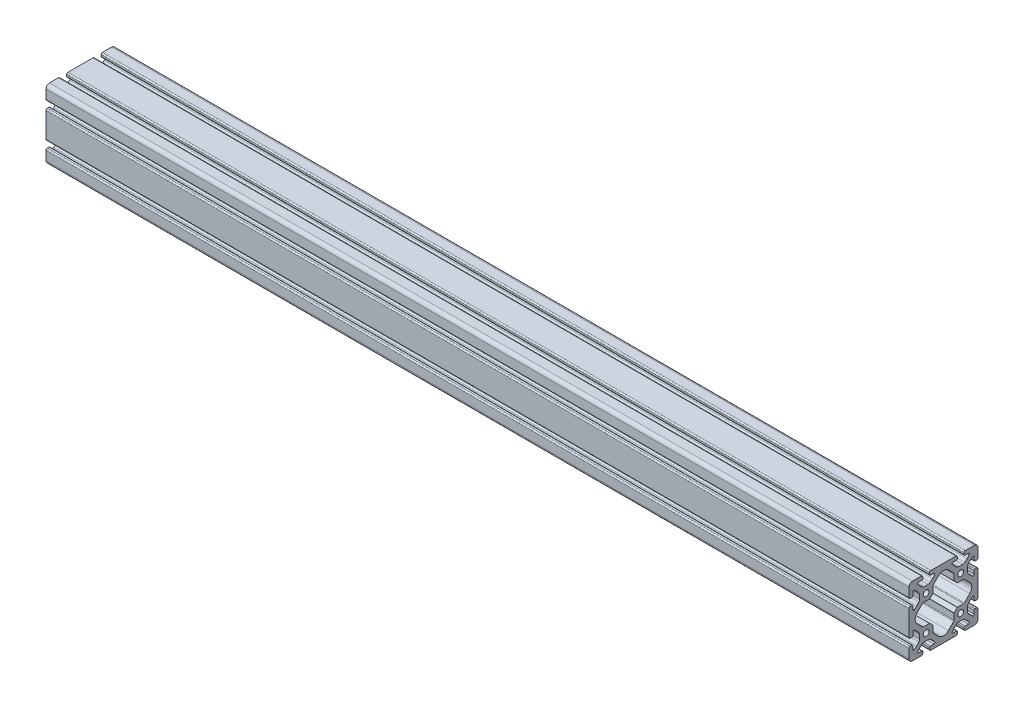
from build123d import *

# Parameters (mm, degrees)
MODEL_R                = 3.4
STRUKTURBAUTEIL1_DEPTH = 1000


with BuildPart() as part:
    # Model → Strukturbauteil1 (new body)
    with BuildSketch(Plane(origin=(0, 0, 0), x_dir=(0, 0, -1), z_dir=(1, 0, 0))):
        with BuildLine():
            Line((-40, -25.5), (-40, -36))
            ThreePointArc((-40, -36), (-38.828427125, -38.828427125), (-36, -40))
            Line((-36, -40), (-25.5, -40))
            ThreePointArc((-25.5, -40), (-24.439339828, -39.560660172), (-24, -38.5))
            Line((-24, -38.5), (-24, -36.5))
            ThreePointArc((-24, -36.5), (-24.292893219, -35.792893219), (-25, -35.5))
            Line((-25, -35.5), (-28.91611505, -35.5))
            ThreePointArc((-28.91611505, -35.5), (-29.883468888, -34.905025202), (-29.788807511, -33.773297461))
            Line((-29.788807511, -33.773297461), (-27.378794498, -30.963551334))
            Line((-27.378794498, -30.963551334), (-24.580305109, -28.54047619))
            ThreePointArc((-24.580305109, -28.54047619), (-23.45041558, -27.952757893), (-22.193056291, -27.75))
            Line((-22.193056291, -27.75), (-17.806943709, -27.75))
            ThreePointArc((-17.806943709, -27.75), (-16.54958442, -27.952757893), (-15.419694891, -28.54047619))
            Line((-15.419694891, -28.54047619), (-12.621205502, -30.963551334))
            Line((-12.621205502, -30.963551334), (-10.211192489, -33.773297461))
            ThreePointArc((-10.211192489, -33.773297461), (-10.116531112, -34.905025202), (-11.08388495, -35.5))
            Line((-11.08388495, -35.5), (-15, -35.5))
            ThreePointArc((-15, -35.5), (-15.707106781, -35.792893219), (-16, -36.5))
            Line((-16, -36.5), (-16, -38.5))
            ThreePointArc((-16, -38.5), (-15.560660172, -39.560660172), (-14.5, -40))
            Line((-14.5, -40), (14.5, -40))
            ThreePointArc((14.5, -40), (15.560660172, -39.560660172), (16, -38.5))
            Line((16, -38.5), (16, -36.5))
            ThreePointArc((16, -36.5), (15.707106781, -35.792893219), (15, -35.5))
            Line((15, -35.5), (11.08388495, -35.5))
            ThreePointArc((11.08388495, -35.5), (10.116531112, -34.905025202), (10.211192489, -33.773297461))
            Line((10.211192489, -33.773297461), (12.621205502, -30.963551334))
            Line((12.621205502, -30.963551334), (15.419694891, -28.54047619))
            ThreePointArc((15.419694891, -28.54047619), (16.54958442, -27.952757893), (17.806943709, -27.75))
            Line((17.806943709, -27.75), (22.193056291, -27.75))
            ThreePointArc((22.193056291, -27.75), (23.45041558, -27.952757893), (24.580305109, -28.54047619))
            Line((24.580305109, -28.54047619), (27.378794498, -30.963551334))
            Line((27.378794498, -30.963551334), (29.788807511, -33.773297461))
            ThreePointArc((29.788807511, -33.773297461), (29.883468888, -34.905025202), (28.91611505, -35.5))
            Line((28.91611505, -35.5), (25, -35.5))
            ThreePointArc((25, -35.5), (24.292893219, -35.792893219), (24, -36.5))
            Line((24, -36.5), (24, -38.5))
            ThreePointArc((24, -38.5), (24.439339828, -39.560660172), (25.5, -40))
            Line((25.5, -40), (36, -40))
            ThreePointArc((36, -40), (38.828427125, -38.828427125), (40, -36))
            Line((40, -36), (40, -25.5))
            ThreePointArc((40, -25.5), (39.560660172, -24.439339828), (38.5, -24))
            Line((38.5, -24), (36.5, -24))
            ThreePointArc((36.5, -24), (35.792893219, -24.292893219), (35.5, -25))
            Line((35.5, -25), (35.5, -28.91611505))
            ThreePointArc((35.5, -28.91611505), (34.905025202, -29.883468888), (33.773297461, -29.788807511))
            Line((33.773297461, -29.788807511), (30.963551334, -27.378794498))
            Line((30.963551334, -27.378794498), (28.54047619, -24.580305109))
            ThreePointArc((28.54047619, -24.580305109), (27.952757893, -23.45041558), (27.75, -22.193056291))
            Line((27.75, -22.193056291), (27.75, -17.806943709))
            ThreePointArc((27.75, -17.806943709), (27.952757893, -16.54958442), (28.54047619, -15.419694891))
            Line((28.54047619, -15.419694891), (30.963551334, -12.621205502))
            Line((30.963551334, -12.621205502), (33.773297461, -10.211192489))
            ThreePointArc((33.773297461, -10.211192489), (34.905025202, -10.116531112), (35.5, -11.08388495))
            Line((35.5, -11.08388495), (35.5, -15))
            ThreePointArc((35.5, -15), (35.792893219, -15.707106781), (36.5, -16))
            Line((36.5, -16), (38.5, -16))
            ThreePointArc((38.5, -16), (39.560660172, -15.560660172), (40, -14.5))
            Line((40, -14.5), (40, 14.5))
            ThreePointArc((40, 14.5), (39.560660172, 15.560660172), (38.5, 16))
            Line((38.5, 16), (36.5, 16))
            ThreePointArc((36.5, 16), (35.792893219, 15.707106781), (35.5, 15))
            Line((35.5, 15), (35.5, 11.08388495))
            ThreePointArc((35.5, 11.08388495), (34.905025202, 10.116531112), (33.773297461, 10.211192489))
            Line((33.773297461, 10.211192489), (30.963551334, 12.621205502))
            Line((30.963551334, 12.621205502), (28.54047619, 15.419694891))
            ThreePointArc((28.54047619, 15.419694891), (27.952757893, 16.54958442), (27.75, 17.806943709))
            Line((27.75, 17.806943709), (27.75, 22.193056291))
            ThreePointArc((27.75, 22.193056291), (27.952757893, 23.45041558), (28.54047619, 24.580305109))
            Line((28.54047619, 24.580305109), (30.963551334, 27.378794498))
            Line((30.963551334, 27.378794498), (33.773297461, 29.788807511))
            ThreePointArc((33.773297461, 29.788807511), (34.905025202, 29.883468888), (35.5, 28.91611505))
            Line((35.5, 28.91611505), (35.5, 25))
            ThreePointArc((35.5, 25), (35.792893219, 24.292893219), (36.5, 24))
            Line((36.5, 24), (38.5, 24))
            ThreePointArc((38.5, 24), (39.560660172, 24.439339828), (40, 25.5))
            Line((40, 25.5), (40, 36))
            ThreePointArc((40, 36), (38.828427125, 38.828427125), (36, 40))
            Line((36, 40), (25.5, 40))
            ThreePointArc((25.5, 40), (24.439339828, 39.560660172), (24, 38.5))
            Line((24, 38.5), (24, 36.5))
            ThreePointArc((24, 36.5), (24.292893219, 35.792893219), (25, 35.5))
            Line((25, 35.5), (28.91611505, 35.5))
            ThreePointArc((28.91611505, 35.5), (29.883468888, 34.905025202), (29.788807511, 33.773297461))
            Line((29.788807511, 33.773297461), (27.378794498, 30.963551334))
            Line((27.378794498, 30.963551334), (24.580305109, 28.54047619))
            ThreePointArc((24.580305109, 28.54047619), (23.45041558, 27.952757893), (22.193056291, 27.75))
            Line((22.193056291, 27.75), (17.806943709, 27.75))
            ThreePointArc((17.806943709, 27.75), (16.54958442, 27.952757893), (15.419694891, 28.54047619))
            Line((15.419694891, 28.54047619), (12.621205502, 30.963551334))
            Line((12.621205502, 30.963551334), (10.211192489, 33.773297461))
            ThreePointArc((10.211192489, 33.773297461), (10.116531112, 34.905025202), (11.08388495, 35.5))
            Line((11.08388495, 35.5), (15, 35.5))
            ThreePointArc((15, 35.5), (15.707106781, 35.792893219), (16, 36.5))
            Line((16, 36.5), (16, 38.5))
            ThreePointArc((16, 38.5), (15.560660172, 39.560660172), (14.5, 40))
            Line((14.5, 40), (-14.5, 40))
            ThreePointArc((-14.5, 40), (-15.560660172, 39.560660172), (-16, 38.5))
            Line((-16, 38.5), (-16, 36.5))
            ThreePointArc((-16, 36.5), (-15.707106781, 35.792893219), (-15, 35.5))
            Line((-15, 35.5), (-11.08388495, 35.5))
            ThreePointArc((-11.08388495, 35.5), (-10.116531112, 34.905025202), (-10.211192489, 33.773297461))
            Line((-10.211192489, 33.773297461), (-12.621205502, 30.963551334))
            Line((-12.621205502, 30.963551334), (-15.419694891, 28.54047619))
            ThreePointArc((-15.419694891, 28.54047619), (-16.54958442, 27.952757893), (-17.806943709, 27.75))
            Line((-17.806943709, 27.75), (-22.193056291, 27.75))
            ThreePointArc((-22.193056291, 27.75), (-23.45041558, 27.952757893), (-24.580305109, 28.54047619))
            Line((-24.580305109, 28.54047619), (-27.378794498, 30.963551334))
            Line((-27.378794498, 30.963551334), (-29.788807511, 33.773297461))
            ThreePointArc((-29.788807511, 33.773297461), (-29.883468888, 34.905025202), (-28.91611505, 35.5))
            Line((-28.91611505, 35.5), (-25, 35.5))
            ThreePointArc((-25, 35.5), (-24.292893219, 35.792893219), (-24, 36.5))
            Line((-24, 36.5), (-24, 38.5))
            ThreePointArc((-24, 38.5), (-24.439339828, 39.560660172), (-25.5, 40))
            Line((-25.5, 40), (-36, 40))
            ThreePointArc((-36, 40), (-38.828427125, 38.828427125), (-40, 36))
            Line((-40, 36), (-40, 25.5))
            ThreePointArc((-40, 25.5), (-39.560660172, 24.439339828), (-38.5, 24))
            Line((-38.5, 24), (-36.5, 24))
            ThreePointArc((-36.5, 24), (-35.792893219, 24.292893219), (-35.5, 25))
            Line((-35.5, 25), (-35.5, 28.91611505))
            ThreePointArc((-35.5, 28.91611505), (-34.905025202, 29.883468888), (-33.773297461, 29.788807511))
            Line((-33.773297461, 29.788807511), (-30.963551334, 27.378794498))
            Line((-30.963551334, 27.378794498), (-28.54047619, 24.580305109))
            ThreePointArc((-28.54047619, 24.580305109), (-27.952757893, 23.45041558), (-27.75, 22.193056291))
            Line((-27.75, 22.193056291), (-27.75, 17.806943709))
            ThreePointArc((-27.75, 17.806943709), (-27.952757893, 16.54958442), (-28.54047619, 15.419694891))
            Line((-28.54047619, 15.419694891), (-30.963551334, 12.621205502))
            Line((-30.963551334, 12.621205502), (-33.773297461, 10.211192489))
            ThreePointArc((-33.773297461, 10.211192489), (-34.905025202, 10.116531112), (-35.5, 11.08388495))
            Line((-35.5, 11.08388495), (-35.5, 15))
            ThreePointArc((-35.5, 15), (-35.792893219, 15.707106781), (-36.5, 16))
            Line((-36.5, 16), (-38.5, 16))
            ThreePointArc((-38.5, 16), (-39.560660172, 15.560660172), (-40, 14.5))
            Line((-40, 14.5), (-40, -14.5))
            ThreePointArc((-40, -14.5), (-39.560660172, -15.560660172), (-38.5, -16))
            Line((-38.5, -16), (-36.5, -16))
            ThreePointArc((-36.5, -16), (-35.792893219, -15.707106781), (-35.5, -15))
            Line((-35.5, -15), (-35.5, -11.08388495))
            ThreePointArc((-35.5, -11.08388495), (-34.905025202, -10.116531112), (-33.773297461, -10.211192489))
            Line((-33.773297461, -10.211192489), (-30.963551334, -12.621205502))
            Line((-30.963551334, -12.621205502), (-28.54047619, -15.419694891))
            ThreePointArc((-28.54047619, -15.419694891), (-27.952757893, -16.54958442), (-27.75, -17.806943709))
            Line((-27.75, -17.806943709), (-27.75, -22.193056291))
            ThreePointArc((-27.75, -22.193056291), (-27.952757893, -23.45041558), (-28.54047619, -24.580305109))
            Line((-28.54047619, -24.580305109), (-30.963551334, -27.378794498))
            Line((-30.963551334, -27.378794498), (-33.773297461, -29.788807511))
            ThreePointArc((-33.773297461, -29.788807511), (-34.905025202, -29.883468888), (-35.5, -28.91611505))
            Line((-35.5, -28.91611505), (-35.5, -25))
            ThreePointArc((-35.5, -25), (-35.792893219, -24.292893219), (-36.5, -24))
            Line((-36.5, -24), (-38.5, -24))
            ThreePointArc((-38.5, -24), (-39.560660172, -24.439339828), (-40, -25.5))
        make_face()
        with Locations((-20, -20)):
            Circle(MODEL_R, mode=Mode.SUBTRACT)
        with Locations((20, -20)):
            Circle(MODEL_R, mode=Mode.SUBTRACT)
        with Locations((-20, 20)):
            Circle(MODEL_R, mode=Mode.SUBTRACT)
        with Locations((20, 20)):
            Circle(MODEL_R, mode=Mode.SUBTRACT)
        with BuildLine():
            Line((-24.306953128, 11.81066014), (-30.460759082, 5.656854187))
            ThreePointArc((-30.460759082, 5.656854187), (-32.803904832, -6.3e-08), (-30.460759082, -5.656854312))
            Line((-30.460759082, -5.656854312), (-24.306953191, -11.810660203))
            ThreePointArc((-24.306953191, -11.810660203), (-23.820318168, -12.13581933), (-23.246293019, -12.250000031))
            Line((-23.246293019, -12.250000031), (-16.158535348, -12.250000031))
            ThreePointArc((-16.158535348, -12.250000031), (-16.043730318, -12.272836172), (-15.946403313, -12.337867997))
            Line((-15.946403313, -12.337867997), (-12.337867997, -15.946403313))
            ThreePointArc((-12.337867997, -15.946403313), (-12.272836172, -16.043730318), (-12.250000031, -16.158535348))
            Line((-12.250000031, -16.158535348), (-12.250000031, -23.246293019))
            ThreePointArc((-12.250000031, -23.246293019), (-12.13581933, -23.820318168), (-11.810660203, -24.306953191))
            Line((-11.810660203, -24.306953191), (-5.656854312, -30.460759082))
            ThreePointArc((-5.656854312, -30.460759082), (-6.3e-08, -32.803904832), (5.656854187, -30.460759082))
            Line((5.656854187, -30.460759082), (11.81066014, -24.306953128))
            ThreePointArc((11.81066014, -24.306953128), (12.135819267, -23.820318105), (12.249999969, -23.246292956))
            Line((12.249999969, -23.246292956), (12.249999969, -16.158535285))
            ThreePointArc((12.249999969, -16.158535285), (12.272836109, -16.043730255), (12.337867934, -15.94640325))
            Line((12.337867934, -15.94640325), (15.94640325, -12.337867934))
            ThreePointArc((15.94640325, -12.337867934), (16.043730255, -12.272836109), (16.158535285, -12.249999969))
            Line((16.158535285, -12.249999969), (23.246292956, -12.249999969))
            ThreePointArc((23.246292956, -12.249999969), (23.820318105, -12.135819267), (24.306953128, -11.81066014))
            Line((24.306953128, -11.81066014), (30.460759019, -5.656854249))
            ThreePointArc((30.460759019, -5.656854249), (32.80390477, 0), (30.460759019, 5.656854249))
            Line((30.460759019, 5.656854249), (24.306953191, 11.810660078))
            ThreePointArc((24.306953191, 11.810660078), (23.820318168, 12.135819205), (23.246293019, 12.249999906))
            Line((23.246293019, 12.249999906), (16.158535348, 12.249999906))
            ThreePointArc((16.158535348, 12.249999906), (16.043730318, 12.272836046), (15.946403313, 12.337867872))
            Line((15.946403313, 12.337867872), (12.337867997, 15.946403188))
            ThreePointArc((12.337867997, 15.946403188), (12.272836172, 16.043730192), (12.250000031, 16.158535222))
            Line((12.250000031, 16.158535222), (12.250000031, 23.246292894))
            ThreePointArc((12.250000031, 23.246292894), (12.13581933, 23.820318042), (11.810660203, 24.306953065))
            Line((11.810660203, 24.306953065), (5.656854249, 30.460759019))
            ThreePointArc((5.656854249, 30.460759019), (0, 32.80390477), (-5.656854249, 30.460759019))
            Line((-5.656854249, 30.460759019), (-11.81066014, 24.306953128))
            ThreePointArc((-11.81066014, 24.306953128), (-12.135819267, 23.820318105), (-12.249999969, 23.246292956))
            Line((-12.249999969, 23.246292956), (-12.249999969, 16.158535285))
            ThreePointArc((-12.249999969, 16.158535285), (-12.272836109, 16.043730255), (-12.337867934, 15.94640325))
            Line((-12.337867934, 15.94640325), (-15.94640325, 12.337867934))
            ThreePointArc((-15.94640325, 12.337867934), (-16.043730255, 12.272836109), (-16.158535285, 12.249999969))
            Line((-16.158535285, 12.249999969), (-23.246292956, 12.249999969))
            ThreePointArc((-23.246292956, 12.249999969), (-23.820318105, 12.135819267), (-24.306953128, 11.81066014))
        make_face(mode=Mode.SUBTRACT)
    extrude(amount=STRUKTURBAUTEIL1_DEPTH)


solid = part.part
